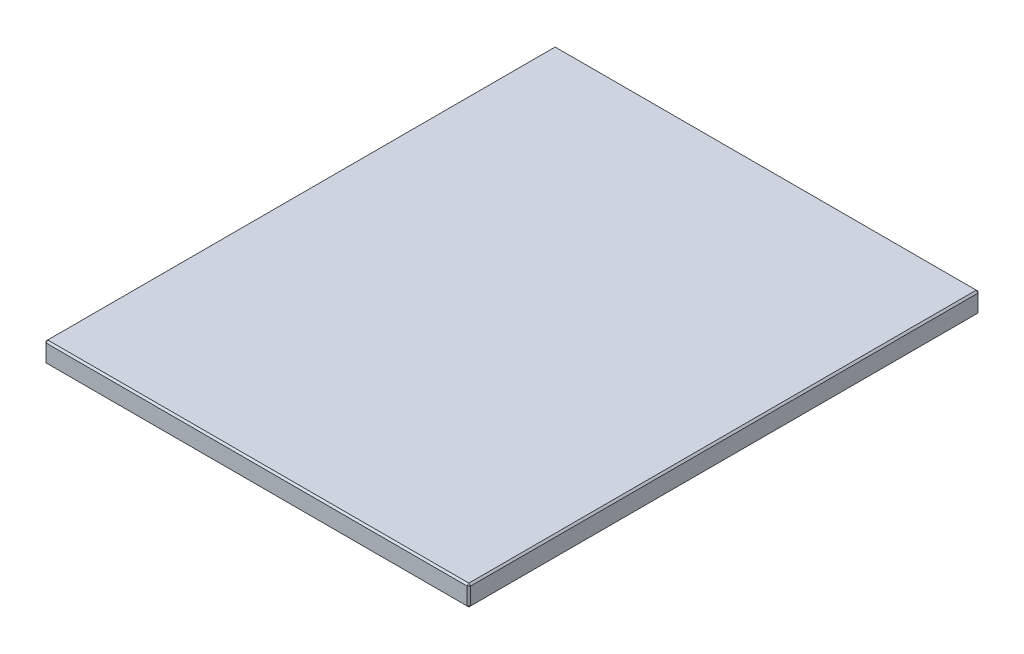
ISO-10303-21;
HEADER;
FILE_DESCRIPTION(('STEP AP214'),'2;1');
FILE_NAME('part.step','',(''),(''),'','','');
FILE_SCHEMA(('AUTOMOTIVE_DESIGN { 1 0 10303 214 1 1 1 1 }'));
ENDSEC;
DATA;
#1=APPLICATION_CONTEXT('core data for automotive mechanical design processes');
#2=APPLICATION_PROTOCOL_DEFINITION('international standard','automotive_design',2000,#1);
#3=PRODUCT_CONTEXT('',#1,'mechanical');
#4=PRODUCT('Part','Part','',(#3));
#5=PRODUCT_RELATED_PRODUCT_CATEGORY('part','',(#4));
#6=PRODUCT_DEFINITION_FORMATION('','',#4);
#7=PRODUCT_DEFINITION_CONTEXT('part definition',#1,'design');
#8=PRODUCT_DEFINITION('design','',#6,#7);
#9=PRODUCT_DEFINITION_SHAPE('','',#8);
#10=(LENGTH_UNIT() NAMED_UNIT(*) SI_UNIT(.MILLI.,.METRE.));
#11=(NAMED_UNIT(*) PLANE_ANGLE_UNIT() SI_UNIT($,.RADIAN.));
#12=(NAMED_UNIT(*) SI_UNIT($,.STERADIAN.) SOLID_ANGLE_UNIT());
#13=UNCERTAINTY_MEASURE_WITH_UNIT(LENGTH_MEASURE(1.E-05),#10,'distance_accuracy_value','');
#14=(GEOMETRIC_REPRESENTATION_CONTEXT(3) GLOBAL_UNCERTAINTY_ASSIGNED_CONTEXT((#13)) GLOBAL_UNIT_ASSIGNED_CONTEXT((#10,
#11,#12)) REPRESENTATION_CONTEXT('',''));
#15=CARTESIAN_POINT('',(0.,0.,0.));
#16=DIRECTION('',(0.,0.,1.));
#17=DIRECTION('',(1.,0.,0.));
#18=AXIS2_PLACEMENT_3D('',#15,#16,#17);
#19=CARTESIAN_POINT('',(-123.,12.,148.));
#20=DIRECTION('',(1.,0.,0.));
#21=DIRECTION('',(0.,0.,-1.));
#22=AXIS2_PLACEMENT_3D('',#19,#20,#21);
#23=PLANE('',#22);
#24=DIRECTION('',(0.,-1.,0.));
#25=VECTOR('',#24,1.);
#26=CARTESIAN_POINT('',(-123.,12.,-147.));
#27=LINE('',#26,#25);
#28=CARTESIAN_POINT('',(-123.,11.,-147.));
#29=VERTEX_POINT('',#28);
#30=CARTESIAN_POINT('',(-123.,1.,-147.));
#31=VERTEX_POINT('',#30);
#32=EDGE_CURVE('E115',#29,#31,#27,.T.);
#33=ORIENTED_EDGE('',*,*,#32,.T.);
#34=DIRECTION('',(0.,0.,1.));
#35=VECTOR('',#34,1.);
#36=CARTESIAN_POINT('',(-123.,1.,148.));
#37=LINE('',#36,#35);
#38=CARTESIAN_POINT('',(-123.,1.,147.));
#39=VERTEX_POINT('',#38);
#40=EDGE_CURVE('E111',#31,#39,#37,.T.);
#41=ORIENTED_EDGE('',*,*,#40,.T.);
#42=DIRECTION('',(0.,1.,0.));
#43=VECTOR('',#42,1.);
#44=CARTESIAN_POINT('',(-123.,12.,147.));
#45=LINE('',#44,#43);
#46=CARTESIAN_POINT('',(-123.,11.,147.));
#47=VERTEX_POINT('',#46);
#48=EDGE_CURVE('E104',#39,#47,#45,.T.);
#49=ORIENTED_EDGE('',*,*,#48,.T.);
#50=DIRECTION('',(0.,0.,-1.));
#51=VECTOR('',#50,1.);
#52=CARTESIAN_POINT('',(-123.,11.,-148.));
#53=LINE('',#52,#51);
#54=EDGE_CURVE('E108',#47,#29,#53,.T.);
#55=ORIENTED_EDGE('',*,*,#54,.T.);
#56=EDGE_LOOP('',(#33,#41,#49,#55));
#57=FACE_BOUND('',#56,.T.);
#58=ADVANCED_FACE('F16',(#57),#23,.F.);
#59=CARTESIAN_POINT('',(123.,12.,148.));
#60=DIRECTION('',(0.,0.,-1.));
#61=DIRECTION('',(-1.,0.,0.));
#62=AXIS2_PLACEMENT_3D('',#59,#60,#61);
#63=PLANE('',#62);
#64=DIRECTION('',(-1.,0.,0.));
#65=VECTOR('',#64,1.);
#66=CARTESIAN_POINT('',(-123.,11.,148.));
#67=LINE('',#66,#65);
#68=CARTESIAN_POINT('',(122.,11.,148.));
#69=VERTEX_POINT('',#68);
#70=CARTESIAN_POINT('',(-122.,11.,148.));
#71=VERTEX_POINT('',#70);
#72=EDGE_CURVE('E165',#69,#71,#67,.T.);
#73=ORIENTED_EDGE('',*,*,#72,.T.);
#74=DIRECTION('',(0.,-1.,0.));
#75=VECTOR('',#74,1.);
#76=CARTESIAN_POINT('',(-122.,12.,148.));
#77=LINE('',#76,#75);
#78=CARTESIAN_POINT('',(-122.,1.,148.));
#79=VERTEX_POINT('',#78);
#80=EDGE_CURVE('E123',#71,#79,#77,.T.);
#81=ORIENTED_EDGE('',*,*,#80,.T.);
#82=DIRECTION('',(1.,0.,0.));
#83=VECTOR('',#82,1.);
#84=CARTESIAN_POINT('',(123.,1.,148.));
#85=LINE('',#84,#83);
#86=CARTESIAN_POINT('',(122.,1.,148.));
#87=VERTEX_POINT('',#86);
#88=EDGE_CURVE('E169',#79,#87,#85,.T.);
#89=ORIENTED_EDGE('',*,*,#88,.T.);
#90=DIRECTION('',(0.,1.,0.));
#91=VECTOR('',#90,1.);
#92=CARTESIAN_POINT('',(122.,12.,148.));
#93=LINE('',#92,#91);
#94=EDGE_CURVE('E167',#87,#69,#93,.T.);
#95=ORIENTED_EDGE('',*,*,#94,.T.);
#96=EDGE_LOOP('',(#73,#81,#89,#95));
#97=FACE_BOUND('',#96,.T.);
#98=ADVANCED_FACE('F276',(#97),#63,.F.);
#99=CARTESIAN_POINT('',(123.,12.,148.));
#100=DIRECTION('',(-1.,0.,0.));
#101=DIRECTION('',(0.,0.,1.));
#102=AXIS2_PLACEMENT_3D('',#99,#100,#101);
#103=PLANE('',#102);
#104=DIRECTION('',(0.,0.,-1.));
#105=VECTOR('',#104,1.);
#106=CARTESIAN_POINT('',(123.,1.,148.));
#107=LINE('',#106,#105);
#108=CARTESIAN_POINT('',(123.,1.,147.));
#109=VERTEX_POINT('',#108);
#110=CARTESIAN_POINT('',(123.,1.,-147.));
#111=VERTEX_POINT('',#110);
#112=EDGE_CURVE('E160',#109,#111,#107,.T.);
#113=ORIENTED_EDGE('',*,*,#112,.T.);
#114=DIRECTION('',(0.,1.,0.));
#115=VECTOR('',#114,1.);
#116=CARTESIAN_POINT('',(123.,12.,-147.));
#117=LINE('',#116,#115);
#118=CARTESIAN_POINT('',(123.,11.,-147.));
#119=VERTEX_POINT('',#118);
#120=EDGE_CURVE('E162',#111,#119,#117,.T.);
#121=ORIENTED_EDGE('',*,*,#120,.T.);
#122=DIRECTION('',(0.,0.,1.));
#123=VECTOR('',#122,1.);
#124=CARTESIAN_POINT('',(123.,11.,148.));
#125=LINE('',#124,#123);
#126=CARTESIAN_POINT('',(123.,11.,147.));
#127=VERTEX_POINT('',#126);
#128=EDGE_CURVE('E156',#119,#127,#125,.T.);
#129=ORIENTED_EDGE('',*,*,#128,.T.);
#130=DIRECTION('',(0.,-1.,0.));
#131=VECTOR('',#130,1.);
#132=CARTESIAN_POINT('',(123.,12.,147.));
#133=LINE('',#132,#131);
#134=EDGE_CURVE('E158',#127,#109,#133,.T.);
#135=ORIENTED_EDGE('',*,*,#134,.T.);
#136=EDGE_LOOP('',(#113,#121,#129,#135));
#137=FACE_BOUND('',#136,.T.);
#138=ADVANCED_FACE('F255',(#137),#103,.F.);
#139=CARTESIAN_POINT('',(123.,12.,-148.));
#140=DIRECTION('',(0.,0.,1.));
#141=DIRECTION('',(1.,0.,0.));
#142=AXIS2_PLACEMENT_3D('',#139,#140,#141);
#143=PLANE('',#142);
#144=DIRECTION('',(0.,-1.,0.));
#145=VECTOR('',#144,1.);
#146=CARTESIAN_POINT('',(122.,12.,-148.));
#147=LINE('',#146,#145);
#148=CARTESIAN_POINT('',(122.,11.,-148.));
#149=VERTEX_POINT('',#148);
#150=CARTESIAN_POINT('',(122.,1.,-148.));
#151=VERTEX_POINT('',#150);
#152=EDGE_CURVE('E149',#149,#151,#147,.T.);
#153=ORIENTED_EDGE('',*,*,#152,.T.);
#154=DIRECTION('',(-1.,0.,0.));
#155=VECTOR('',#154,1.);
#156=CARTESIAN_POINT('',(123.,1.,-148.));
#157=LINE('',#156,#155);
#158=CARTESIAN_POINT('',(-122.,1.,-148.));
#159=VERTEX_POINT('',#158);
#160=EDGE_CURVE('E154',#151,#159,#157,.T.);
#161=ORIENTED_EDGE('',*,*,#160,.T.);
#162=DIRECTION('',(0.,1.,0.));
#163=VECTOR('',#162,1.);
#164=CARTESIAN_POINT('',(-122.,12.,-148.));
#165=LINE('',#164,#163);
#166=CARTESIAN_POINT('',(-122.,11.,-148.));
#167=VERTEX_POINT('',#166);
#168=EDGE_CURVE('E151',#159,#167,#165,.T.);
#169=ORIENTED_EDGE('',*,*,#168,.T.);
#170=DIRECTION('',(1.,0.,0.));
#171=VECTOR('',#170,1.);
#172=CARTESIAN_POINT('',(123.,11.,-148.));
#173=LINE('',#172,#171);
#174=EDGE_CURVE('E147',#167,#149,#173,.T.);
#175=ORIENTED_EDGE('',*,*,#174,.T.);
#176=EDGE_LOOP('',(#153,#161,#169,#175));
#177=FACE_BOUND('',#176,.T.);
#178=ADVANCED_FACE('F285',(#177),#143,.F.);
#179=CARTESIAN_POINT('',(0.,12.,0.));
#180=DIRECTION('',(0.,1.,0.));
#181=DIRECTION('',(0.,0.,1.));
#182=AXIS2_PLACEMENT_3D('',#179,#180,#181);
#183=PLANE('',#182);
#184=DIRECTION('',(0.,0.,-1.));
#185=VECTOR('',#184,1.);
#186=CARTESIAN_POINT('',(122.,12.,-148.));
#187=LINE('',#186,#185);
#188=CARTESIAN_POINT('',(122.,12.,147.));
#189=VERTEX_POINT('',#188);
#190=CARTESIAN_POINT('',(122.,12.,-147.));
#191=VERTEX_POINT('',#190);
#192=EDGE_CURVE('E25',#189,#191,#187,.T.);
#193=ORIENTED_EDGE('',*,*,#192,.T.);
#194=DIRECTION('',(-1.,0.,0.));
#195=VECTOR('',#194,1.);
#196=CARTESIAN_POINT('',(-123.,12.,-147.));
#197=LINE('',#196,#195);
#198=CARTESIAN_POINT('',(-122.,12.,-147.));
#199=VERTEX_POINT('',#198);
#200=EDGE_CURVE('E10',#191,#199,#197,.T.);
#201=ORIENTED_EDGE('',*,*,#200,.T.);
#202=DIRECTION('',(0.,0.,1.));
#203=VECTOR('',#202,1.);
#204=CARTESIAN_POINT('',(-122.,12.,148.));
#205=LINE('',#204,#203);
#206=CARTESIAN_POINT('',(-122.,12.,147.));
#207=VERTEX_POINT('',#206);
#208=EDGE_CURVE('E181',#199,#207,#205,.T.);
#209=ORIENTED_EDGE('',*,*,#208,.T.);
#210=DIRECTION('',(1.,0.,0.));
#211=VECTOR('',#210,1.);
#212=CARTESIAN_POINT('',(123.,12.,147.));
#213=LINE('',#212,#211);
#214=EDGE_CURVE('E36',#207,#189,#213,.T.);
#215=ORIENTED_EDGE('',*,*,#214,.T.);
#216=EDGE_LOOP('',(#193,#201,#209,#215));
#217=FACE_BOUND('',#216,.T.);
#218=ADVANCED_FACE('F351',(#217),#183,.T.);
#219=CARTESIAN_POINT('',(0.,0.,0.));
#220=DIRECTION('',(0.,1.,0.));
#221=DIRECTION('',(0.,0.,1.));
#222=AXIS2_PLACEMENT_3D('',#219,#220,#221);
#223=PLANE('',#222);
#224=DIRECTION('',(0.,0.,1.));
#225=VECTOR('',#224,1.);
#226=CARTESIAN_POINT('',(122.,0.,0.));
#227=LINE('',#226,#225);
#228=CARTESIAN_POINT('',(122.,0.,-147.));
#229=VERTEX_POINT('',#228);
#230=CARTESIAN_POINT('',(122.,0.,147.));
#231=VERTEX_POINT('',#230);
#232=EDGE_CURVE('E172',#229,#231,#227,.T.);
#233=ORIENTED_EDGE('',*,*,#232,.T.);
#234=DIRECTION('',(-1.,0.,0.));
#235=VECTOR('',#234,1.);
#236=CARTESIAN_POINT('',(0.,0.,147.));
#237=LINE('',#236,#235);
#238=CARTESIAN_POINT('',(-122.,0.,147.));
#239=VERTEX_POINT('',#238);
#240=EDGE_CURVE('E178',#231,#239,#237,.T.);
#241=ORIENTED_EDGE('',*,*,#240,.T.);
#242=DIRECTION('',(0.,0.,-1.));
#243=VECTOR('',#242,1.);
#244=CARTESIAN_POINT('',(-122.,0.,0.));
#245=LINE('',#244,#243);
#246=CARTESIAN_POINT('',(-122.,0.,-147.));
#247=VERTEX_POINT('',#246);
#248=EDGE_CURVE('E176',#239,#247,#245,.T.);
#249=ORIENTED_EDGE('',*,*,#248,.T.);
#250=DIRECTION('',(1.,0.,0.));
#251=VECTOR('',#250,1.);
#252=CARTESIAN_POINT('',(0.,0.,-147.));
#253=LINE('',#252,#251);
#254=EDGE_CURVE('E174',#247,#229,#253,.T.);
#255=ORIENTED_EDGE('',*,*,#254,.T.);
#256=EDGE_LOOP('',(#233,#241,#249,#255));
#257=FACE_BOUND('',#256,.T.);
#258=ADVANCED_FACE('F247',(#257),#223,.F.);
#259=CARTESIAN_POINT('',(123.,12.,147.));
#260=DIRECTION('',(-0.707106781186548,0.,-0.707106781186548));
#261=DIRECTION('',(0.,-1.,0.));
#262=AXIS2_PLACEMENT_3D('',#259,#260,#261);
#263=PLANE('',#262);
#264=DIRECTION('',(-0.707106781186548,0.,0.707106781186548));
#265=VECTOR('',#264,1.);
#266=CARTESIAN_POINT('',(122.,11.,148.));
#267=LINE('',#266,#265);
#268=EDGE_CURVE('E20',#69,#127,#267,.F.);
#269=ORIENTED_EDGE('',*,*,#268,.F.);
#270=ORIENTED_EDGE('',*,*,#94,.F.);
#271=DIRECTION('',(0.707106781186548,0.,-0.707106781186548));
#272=VECTOR('',#271,1.);
#273=CARTESIAN_POINT('',(122.,1.,148.));
#274=LINE('',#273,#272);
#275=EDGE_CURVE('E143',#109,#87,#274,.F.);
#276=ORIENTED_EDGE('',*,*,#275,.F.);
#277=ORIENTED_EDGE('',*,*,#134,.F.);
#278=EDGE_LOOP('',(#269,#270,#276,#277));
#279=FACE_BOUND('',#278,.T.);
#280=ADVANCED_FACE('F18',(#279),#263,.F.);
#281=CARTESIAN_POINT('',(122.,11.,148.));
#282=DIRECTION('',(0.577350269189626,0.577350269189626,0.577350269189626));
#283=DIRECTION('',(0.707106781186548,0.,-0.707106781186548));
#284=AXIS2_PLACEMENT_3D('',#281,#282,#283);
#285=PLANE('',#284);
#286=DIRECTION('',(0.,-0.707106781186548,0.707106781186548));
#287=VECTOR('',#286,1.);
#288=CARTESIAN_POINT('',(122.,11.,148.));
#289=LINE('',#288,#287);
#290=EDGE_CURVE('E227',#69,#189,#289,.F.);
#291=ORIENTED_EDGE('',*,*,#290,.F.);
#292=ORIENTED_EDGE('',*,*,#268,.T.);
#293=DIRECTION('',(-0.707106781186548,0.707106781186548,0.));
#294=VECTOR('',#293,1.);
#295=CARTESIAN_POINT('',(122.5,11.5,147.));
#296=LINE('',#295,#294);
#297=EDGE_CURVE('E229',#189,#127,#296,.F.);
#298=ORIENTED_EDGE('',*,*,#297,.F.);
#299=EDGE_LOOP('',(#291,#292,#298));
#300=FACE_BOUND('',#299,.T.);
#301=ADVANCED_FACE('F271',(#300),#285,.T.);
#302=CARTESIAN_POINT('',(122.,1.,148.));
#303=DIRECTION('',(0.577350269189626,-0.577350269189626,0.577350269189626));
#304=DIRECTION('',(0.707106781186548,0.,-0.707106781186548));
#305=AXIS2_PLACEMENT_3D('',#302,#303,#304);
#306=PLANE('',#305);
#307=DIRECTION('',(-0.707106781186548,-0.707106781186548,0.));
#308=VECTOR('',#307,1.);
#309=CARTESIAN_POINT('',(122.5,0.5,147.));
#310=LINE('',#309,#308);
#311=EDGE_CURVE('E221',#109,#231,#310,.T.);
#312=ORIENTED_EDGE('',*,*,#311,.F.);
#313=ORIENTED_EDGE('',*,*,#275,.T.);
#314=DIRECTION('',(0.,0.707106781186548,0.707106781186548));
#315=VECTOR('',#314,1.);
#316=CARTESIAN_POINT('',(122.,1.,148.));
#317=LINE('',#316,#315);
#318=EDGE_CURVE('E224',#231,#87,#317,.T.);
#319=ORIENTED_EDGE('',*,*,#318,.F.);
#320=EDGE_LOOP('',(#312,#313,#319));
#321=FACE_BOUND('',#320,.T.);
#322=ADVANCED_FACE('F236',(#321),#306,.T.);
#323=CARTESIAN_POINT('',(122.,12.,0.));
#324=DIRECTION('',(0.707106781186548,0.707106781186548,0.));
#325=DIRECTION('',(0.,0.,1.));
#326=AXIS2_PLACEMENT_3D('',#323,#324,#325);
#327=PLANE('',#326);
#328=ORIENTED_EDGE('',*,*,#297,.T.);
#329=ORIENTED_EDGE('',*,*,#128,.F.);
#330=DIRECTION('',(0.707106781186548,-0.707106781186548,0.));
#331=VECTOR('',#330,1.);
#332=CARTESIAN_POINT('',(123.,11.,-147.));
#333=LINE('',#332,#331);
#334=EDGE_CURVE('E216',#191,#119,#333,.T.);
#335=ORIENTED_EDGE('',*,*,#334,.F.);
#336=ORIENTED_EDGE('',*,*,#192,.F.);
#337=EDGE_LOOP('',(#328,#329,#335,#336));
#338=FACE_BOUND('',#337,.T.);
#339=ADVANCED_FACE('F266',(#338),#327,.T.);
#340=CARTESIAN_POINT('',(0.,12.,147.));
#341=DIRECTION('',(0.,0.707106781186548,0.707106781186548));
#342=DIRECTION('',(-1.,0.,0.));
#343=AXIS2_PLACEMENT_3D('',#340,#341,#342);
#344=PLANE('',#343);
#345=ORIENTED_EDGE('',*,*,#290,.T.);
#346=ORIENTED_EDGE('',*,*,#214,.F.);
#347=DIRECTION('',(0.,0.707106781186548,-0.707106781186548));
#348=VECTOR('',#347,1.);
#349=CARTESIAN_POINT('',(-122.,11.5,147.5));
#350=LINE('',#349,#348);
#351=EDGE_CURVE('E127',#71,#207,#350,.T.);
#352=ORIENTED_EDGE('',*,*,#351,.F.);
#353=ORIENTED_EDGE('',*,*,#72,.F.);
#354=EDGE_LOOP('',(#345,#346,#352,#353));
#355=FACE_BOUND('',#354,.T.);
#356=ADVANCED_FACE('F274',(#355),#344,.T.);
#357=CARTESIAN_POINT('',(-122.,12.,148.));
#358=DIRECTION('',(0.707106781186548,0.,-0.707106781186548));
#359=DIRECTION('',(0.,-1.,0.));
#360=AXIS2_PLACEMENT_3D('',#357,#358,#359);
#361=PLANE('',#360);
#362=DIRECTION('',(0.707106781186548,0.,0.707106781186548));
#363=VECTOR('',#362,1.);
#364=CARTESIAN_POINT('',(-122.,1.,148.));
#365=LINE('',#364,#363);
#366=EDGE_CURVE('E128',#79,#39,#365,.F.);
#367=ORIENTED_EDGE('',*,*,#366,.F.);
#368=ORIENTED_EDGE('',*,*,#80,.F.);
#369=DIRECTION('',(-0.707106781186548,0.,-0.707106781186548));
#370=VECTOR('',#369,1.);
#371=CARTESIAN_POINT('',(-123.,11.,147.));
#372=LINE('',#371,#370);
#373=EDGE_CURVE('E119',#47,#71,#372,.F.);
#374=ORIENTED_EDGE('',*,*,#373,.F.);
#375=ORIENTED_EDGE('',*,*,#48,.F.);
#376=EDGE_LOOP('',(#367,#368,#374,#375));
#377=FACE_BOUND('',#376,.T.);
#378=ADVANCED_FACE('F121',(#377),#361,.F.);
#379=CARTESIAN_POINT('',(123.,1.,148.));
#380=DIRECTION('',(0.,0.707106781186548,-0.707106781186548));
#381=DIRECTION('',(1.,0.,0.));
#382=AXIS2_PLACEMENT_3D('',#379,#380,#381);
#383=PLANE('',#382);
#384=ORIENTED_EDGE('',*,*,#318,.T.);
#385=ORIENTED_EDGE('',*,*,#88,.F.);
#386=DIRECTION('',(0.,-0.707106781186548,-0.707106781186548));
#387=VECTOR('',#386,1.);
#388=CARTESIAN_POINT('',(-122.,1.,148.));
#389=LINE('',#388,#387);
#390=EDGE_CURVE('E212',#239,#79,#389,.F.);
#391=ORIENTED_EDGE('',*,*,#390,.F.);
#392=ORIENTED_EDGE('',*,*,#240,.F.);
#393=EDGE_LOOP('',(#384,#385,#391,#392));
#394=FACE_BOUND('',#393,.T.);
#395=ADVANCED_FACE('F244',(#394),#383,.F.);
#396=CARTESIAN_POINT('',(123.,1.,148.));
#397=DIRECTION('',(-0.707106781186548,0.707106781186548,0.));
#398=DIRECTION('',(0.,0.,-1.));
#399=AXIS2_PLACEMENT_3D('',#396,#397,#398);
#400=PLANE('',#399);
#401=ORIENTED_EDGE('',*,*,#311,.T.);
#402=ORIENTED_EDGE('',*,*,#232,.F.);
#403=DIRECTION('',(0.707106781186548,0.707106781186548,0.));
#404=VECTOR('',#403,1.);
#405=CARTESIAN_POINT('',(122.5,0.5,-147.));
#406=LINE('',#405,#404);
#407=EDGE_CURVE('E209',#111,#229,#406,.F.);
#408=ORIENTED_EDGE('',*,*,#407,.F.);
#409=ORIENTED_EDGE('',*,*,#112,.F.);
#410=EDGE_LOOP('',(#401,#402,#408,#409));
#411=FACE_BOUND('',#410,.T.);
#412=ADVANCED_FACE('F252',(#411),#400,.F.);
#413=CARTESIAN_POINT('',(122.,12.,-148.));
#414=DIRECTION('',(-0.707106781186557,0.,0.707106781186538));
#415=DIRECTION('',(0.,-1.,0.));
#416=AXIS2_PLACEMENT_3D('',#413,#414,#415);
#417=PLANE('',#416);
#418=DIRECTION('',(0.707106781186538,0.,0.707106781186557));
#419=VECTOR('',#418,1.);
#420=CARTESIAN_POINT('',(123.,11.,-147.));
#421=LINE('',#420,#419);
#422=EDGE_CURVE('E218',#119,#149,#421,.F.);
#423=ORIENTED_EDGE('',*,*,#422,.F.);
#424=ORIENTED_EDGE('',*,*,#120,.F.);
#425=DIRECTION('',(-0.707106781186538,0.,-0.707106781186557));
#426=VECTOR('',#425,1.);
#427=CARTESIAN_POINT('',(122.,1.,-148.));
#428=LINE('',#427,#426);
#429=EDGE_CURVE('E206',#151,#111,#428,.F.);
#430=ORIENTED_EDGE('',*,*,#429,.F.);
#431=ORIENTED_EDGE('',*,*,#152,.F.);
#432=EDGE_LOOP('',(#423,#424,#430,#431));
#433=FACE_BOUND('',#432,.T.);
#434=ADVANCED_FACE('F259',(#433),#417,.F.);
#435=CARTESIAN_POINT('',(123.,11.,-147.));
#436=DIRECTION('',(0.577350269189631,0.577350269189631,-0.577350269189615));
#437=DIRECTION('',(-0.707106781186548,0.707106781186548,0.));
#438=AXIS2_PLACEMENT_3D('',#435,#436,#437);
#439=PLANE('',#438);
#440=ORIENTED_EDGE('',*,*,#334,.T.);
#441=ORIENTED_EDGE('',*,*,#422,.T.);
#442=DIRECTION('',(0.,0.707106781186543,0.707106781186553));
#443=VECTOR('',#442,1.);
#444=CARTESIAN_POINT('',(122.,11.5,-147.5));
#445=LINE('',#444,#443);
#446=EDGE_CURVE('E135',#191,#149,#445,.F.);
#447=ORIENTED_EDGE('',*,*,#446,.F.);
#448=EDGE_LOOP('',(#440,#441,#447));
#449=FACE_BOUND('',#448,.T.);
#450=ADVANCED_FACE('F326',(#449),#439,.T.);
#451=CARTESIAN_POINT('',(-123.,11.,147.));
#452=DIRECTION('',(-0.577350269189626,0.577350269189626,0.577350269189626));
#453=DIRECTION('',(0.707106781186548,0.,0.707106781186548));
#454=AXIS2_PLACEMENT_3D('',#451,#452,#453);
#455=PLANE('',#454);
#456=ORIENTED_EDGE('',*,*,#373,.T.);
#457=ORIENTED_EDGE('',*,*,#351,.T.);
#458=DIRECTION('',(-0.707106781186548,-0.707106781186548,0.));
#459=VECTOR('',#458,1.);
#460=CARTESIAN_POINT('',(-123.,11.,147.));
#461=LINE('',#460,#459);
#462=EDGE_CURVE('E131',#47,#207,#461,.F.);
#463=ORIENTED_EDGE('',*,*,#462,.F.);
#464=EDGE_LOOP('',(#456,#457,#463));
#465=FACE_BOUND('',#464,.T.);
#466=ADVANCED_FACE('F132',(#465),#455,.T.);
#467=CARTESIAN_POINT('',(-122.,1.,148.));
#468=DIRECTION('',(-0.577350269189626,-0.577350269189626,0.577350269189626));
#469=DIRECTION('',(0.707106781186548,0.,0.707106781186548));
#470=AXIS2_PLACEMENT_3D('',#467,#468,#469);
#471=PLANE('',#470);
#472=ORIENTED_EDGE('',*,*,#390,.T.);
#473=ORIENTED_EDGE('',*,*,#366,.T.);
#474=DIRECTION('',(-0.707106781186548,0.707106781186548,0.));
#475=VECTOR('',#474,1.);
#476=CARTESIAN_POINT('',(-122.5,0.5,147.));
#477=LINE('',#476,#475);
#478=EDGE_CURVE('E136',#239,#39,#477,.T.);
#479=ORIENTED_EDGE('',*,*,#478,.F.);
#480=EDGE_LOOP('',(#472,#473,#479));
#481=FACE_BOUND('',#480,.T.);
#482=ADVANCED_FACE('F319',(#481),#471,.T.);
#483=CARTESIAN_POINT('',(122.,1.,-148.));
#484=DIRECTION('',(0.577350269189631,-0.577350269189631,-0.577350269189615));
#485=DIRECTION('',(0.707106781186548,0.707106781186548,0.));
#486=AXIS2_PLACEMENT_3D('',#483,#484,#485);
#487=PLANE('',#486);
#488=ORIENTED_EDGE('',*,*,#429,.T.);
#489=ORIENTED_EDGE('',*,*,#407,.T.);
#490=DIRECTION('',(0.,-0.707106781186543,0.707106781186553));
#491=VECTOR('',#490,1.);
#492=CARTESIAN_POINT('',(122.,1.,-148.));
#493=LINE('',#492,#491);
#494=EDGE_CURVE('E199',#151,#229,#493,.T.);
#495=ORIENTED_EDGE('',*,*,#494,.F.);
#496=EDGE_LOOP('',(#488,#489,#495));
#497=FACE_BOUND('',#496,.T.);
#498=ADVANCED_FACE('F315',(#497),#487,.T.);
#499=CARTESIAN_POINT('',(0.,12.,-147.));
#500=DIRECTION('',(0.,0.707106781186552,-0.707106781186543));
#501=DIRECTION('',(1.,0.,0.));
#502=AXIS2_PLACEMENT_3D('',#499,#500,#501);
#503=PLANE('',#502);
#504=ORIENTED_EDGE('',*,*,#446,.T.);
#505=ORIENTED_EDGE('',*,*,#174,.F.);
#506=DIRECTION('',(0.,-0.707106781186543,-0.707106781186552));
#507=VECTOR('',#506,1.);
#508=CARTESIAN_POINT('',(-122.,11.,-148.));
#509=LINE('',#508,#507);
#510=EDGE_CURVE('E196',#199,#167,#509,.T.);
#511=ORIENTED_EDGE('',*,*,#510,.F.);
#512=ORIENTED_EDGE('',*,*,#200,.F.);
#513=EDGE_LOOP('',(#504,#505,#511,#512));
#514=FACE_BOUND('',#513,.T.);
#515=ADVANCED_FACE('F312',(#514),#503,.T.);
#516=CARTESIAN_POINT('',(-122.,12.,0.));
#517=DIRECTION('',(-0.707106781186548,0.707106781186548,0.));
#518=DIRECTION('',(0.,0.,-1.));
#519=AXIS2_PLACEMENT_3D('',#516,#517,#518);
#520=PLANE('',#519);
#521=ORIENTED_EDGE('',*,*,#462,.T.);
#522=ORIENTED_EDGE('',*,*,#208,.F.);
#523=DIRECTION('',(0.707106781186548,0.707106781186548,0.));
#524=VECTOR('',#523,1.);
#525=CARTESIAN_POINT('',(-122.5,11.5,-147.));
#526=LINE('',#525,#524);
#527=EDGE_CURVE('E139',#29,#199,#526,.T.);
#528=ORIENTED_EDGE('',*,*,#527,.F.);
#529=ORIENTED_EDGE('',*,*,#54,.F.);
#530=EDGE_LOOP('',(#521,#522,#528,#529));
#531=FACE_BOUND('',#530,.T.);
#532=ADVANCED_FACE('F138',(#531),#520,.T.);
#533=CARTESIAN_POINT('',(-123.,1.,148.));
#534=DIRECTION('',(0.707106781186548,0.707106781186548,0.));
#535=DIRECTION('',(0.,0.,1.));
#536=AXIS2_PLACEMENT_3D('',#533,#534,#535);
#537=PLANE('',#536);
#538=ORIENTED_EDGE('',*,*,#478,.T.);
#539=ORIENTED_EDGE('',*,*,#40,.F.);
#540=DIRECTION('',(0.707106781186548,-0.707106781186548,0.));
#541=VECTOR('',#540,1.);
#542=CARTESIAN_POINT('',(-123.,1.,-147.));
#543=LINE('',#542,#541);
#544=EDGE_CURVE('E192',#247,#31,#543,.F.);
#545=ORIENTED_EDGE('',*,*,#544,.F.);
#546=ORIENTED_EDGE('',*,*,#248,.F.);
#547=EDGE_LOOP('',(#538,#539,#545,#546));
#548=FACE_BOUND('',#547,.T.);
#549=ADVANCED_FACE('F305',(#548),#537,.F.);
#550=CARTESIAN_POINT('',(123.,1.,-148.));
#551=DIRECTION('',(0.,0.707106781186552,0.707106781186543));
#552=DIRECTION('',(-1.,0.,0.));
#553=AXIS2_PLACEMENT_3D('',#550,#551,#552);
#554=PLANE('',#553);
#555=ORIENTED_EDGE('',*,*,#494,.T.);
#556=ORIENTED_EDGE('',*,*,#254,.F.);
#557=DIRECTION('',(0.,0.707106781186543,-0.707106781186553));
#558=VECTOR('',#557,1.);
#559=CARTESIAN_POINT('',(-122.,0.500000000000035,-147.5));
#560=LINE('',#559,#558);
#561=EDGE_CURVE('E189',#159,#247,#560,.F.);
#562=ORIENTED_EDGE('',*,*,#561,.F.);
#563=ORIENTED_EDGE('',*,*,#160,.F.);
#564=EDGE_LOOP('',(#555,#556,#562,#563));
#565=FACE_BOUND('',#564,.T.);
#566=ADVANCED_FACE('F301',(#565),#554,.F.);
#567=CARTESIAN_POINT('',(-122.,11.,-148.));
#568=DIRECTION('',(-0.577350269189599,0.577350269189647,-0.577350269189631));
#569=DIRECTION('',(0.,0.707106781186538,0.707106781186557));
#570=AXIS2_PLACEMENT_3D('',#567,#568,#569);
#571=PLANE('',#570);
#572=ORIENTED_EDGE('',*,*,#527,.T.);
#573=ORIENTED_EDGE('',*,*,#510,.T.);
#574=DIRECTION('',(0.707106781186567,0.,-0.707106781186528));
#575=VECTOR('',#574,1.);
#576=CARTESIAN_POINT('',(-122.,11.,-148.));
#577=LINE('',#576,#575);
#578=EDGE_CURVE('E187',#29,#167,#577,.T.);
#579=ORIENTED_EDGE('',*,*,#578,.F.);
#580=EDGE_LOOP('',(#572,#573,#579));
#581=FACE_BOUND('',#580,.T.);
#582=ADVANCED_FACE('F297',(#581),#571,.T.);
#583=CARTESIAN_POINT('',(-123.,1.,-147.));
#584=DIRECTION('',(-0.577350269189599,-0.577350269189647,-0.577350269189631));
#585=DIRECTION('',(0.,0.707106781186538,-0.707106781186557));
#586=AXIS2_PLACEMENT_3D('',#583,#584,#585);
#587=PLANE('',#586);
#588=ORIENTED_EDGE('',*,*,#561,.T.);
#589=ORIENTED_EDGE('',*,*,#544,.T.);
#590=DIRECTION('',(-0.707106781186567,0.,0.707106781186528));
#591=VECTOR('',#590,1.);
#592=CARTESIAN_POINT('',(-123.,1.,-147.));
#593=LINE('',#592,#591);
#594=EDGE_CURVE('E185',#159,#31,#593,.T.);
#595=ORIENTED_EDGE('',*,*,#594,.F.);
#596=EDGE_LOOP('',(#588,#589,#595));
#597=FACE_BOUND('',#596,.T.);
#598=ADVANCED_FACE('F293',(#597),#587,.T.);
#599=CARTESIAN_POINT('',(-123.,12.,-147.));
#600=DIRECTION('',(0.707106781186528,0.,0.707106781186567));
#601=DIRECTION('',(0.,-1.,0.));
#602=AXIS2_PLACEMENT_3D('',#599,#600,#601);
#603=PLANE('',#602);
#604=ORIENTED_EDGE('',*,*,#578,.T.);
#605=ORIENTED_EDGE('',*,*,#168,.F.);
#606=ORIENTED_EDGE('',*,*,#594,.T.);
#607=ORIENTED_EDGE('',*,*,#32,.F.);
#608=EDGE_LOOP('',(#604,#605,#606,#607));
#609=FACE_BOUND('',#608,.T.);
#610=ADVANCED_FACE('F290',(#609),#603,.F.);
#611=CLOSED_SHELL('',(#58,#98,#138,#178,#218,#258,#280,#301,#322,#339,#356,#378,#395,#412,#434,
#450,#466,#482,#498,#515,#532,#549,#566,#582,#598,#610));
#612=MANIFOLD_SOLID_BREP('B1',#611);
#613=ADVANCED_BREP_SHAPE_REPRESENTATION('',(#18,#612),#14);
#614=SHAPE_DEFINITION_REPRESENTATION(#9,#613);
ENDSEC;
END-ISO-10303-21;
